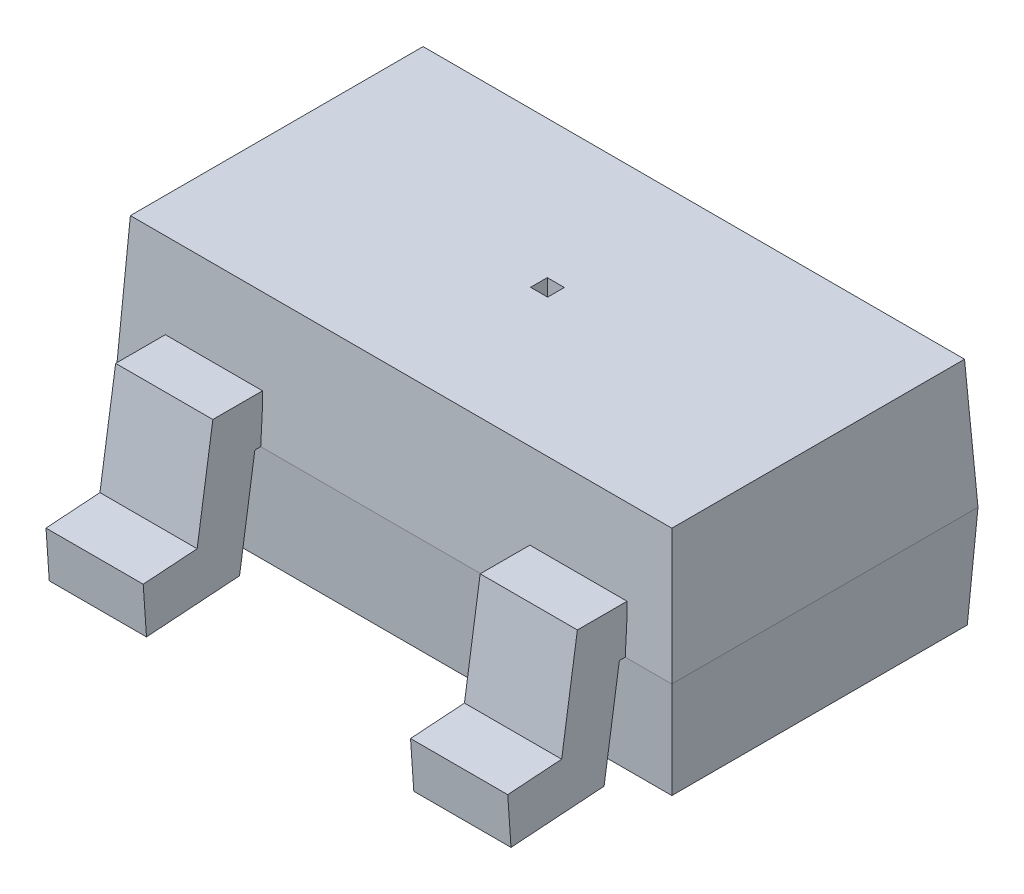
from build123d import *

# Parameters (mm, degrees)
SKETCH1_W           = 2.9
SKETCH1_H           = 1.6
BOSS_EXTRUDE1_DEPTH = 0.533
BOSS_EXTRUDE1_DRAFT = -3
SKETCH5_W           = 2.9
SKETCH5_H           = 1.6
BOSS_EXTRUDE4_DEPTH = 0.67
BOSS_EXTRUDE4_TAPER = 3
BOSS_EXTRUDE5_DEPTH = 0.254
BOSS_EXTRUDE6_START = 0.6985
BOSS_EXTRUDE6_DEPTH = 0.508
BOSS_EXTRUDE7_START = -0.6985
BOSS_EXTRUDE7_DEPTH = 0.508
SKETCH9_W           = 0.089302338
SKETCH9_H           = 0.087441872
CUT_EXTRUDE1_DEPTH  = 0.762


with BuildPart() as part:
    # Sketch1 → Boss-Extrude1 (with draft: the straight prism first)
    with BuildSketch(Plane(origin=(0, 0, 0), x_dir=(1, 0, 0), z_dir=(0, 1, 0))):
        Rectangle(SKETCH1_W, SKETCH1_H)
    extrude(amount=-BOSS_EXTRUDE1_DEPTH)
    # Boss-Extrude1: the draft: its side faces are tilted about the plane it starts from
    boss_extrude1_sides = [part.faces().sort_by_distance(p)[0] for p in [
        (-1.45, -0.2665, 0),
        (0, -0.2665, 0.8),
        (1.45, -0.2665, 0),
        (0, -0.2665, -0.8),
    ]]
    draft(boss_extrude1_sides, Plane(origin=(0, 0, 0), x_dir=(1, 0, 0), z_dir=(0, 1, 0)), BOSS_EXTRUDE1_DRAFT)

    # Sketch5 → Boss-Extrude4 (add)
    with BuildSketch(Plane(origin=(0, 0, 0), x_dir=(1, 0, 0), z_dir=(0, 1, 0))):
        Rectangle(SKETCH5_W, SKETCH5_H)
    extrude(amount=BOSS_EXTRUDE4_DEPTH, taper=BOSS_EXTRUDE4_TAPER)

    # Sketch6 → Boss-Extrude5 (add, symmetric)
    with BuildSketch(Plane(origin=(0, 0, 0), x_dir=(0, 0, -1), z_dir=(1, 0, 0))):
        Polygon((0.790460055, 0), (0.830732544, 0), (0.910586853, -0.529179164), (1.397, -0.562855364), (1.414128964, -0.315447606), (1.132265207, -0.295933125), (1.050184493, 0.248), (0.790460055, 0.248), align=None)
    extrude(amount=BOSS_EXTRUDE5_DEPTH, both=True)

    # Sketch7 → Boss-Extrude6 (add)
    with BuildSketch(Plane(origin=(0, 0, 0), x_dir=(0, 0, -1), z_dir=(1, 0, 0)).offset(BOSS_EXTRUDE6_START)):
        Polygon((-0.790460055, 0.248), (-0.790460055, 0), (-0.830732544, 0), (-0.910586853, -0.529179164), (-1.397, -0.562855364), (-1.414128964, -0.315447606), (-1.132265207, -0.295933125), (-1.050184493, 0.248), align=None)
    extrude(amount=BOSS_EXTRUDE6_DEPTH)

    # Sketch8 → Boss-Extrude7 (add)
    with BuildSketch(Plane(origin=(0, 0, 0), x_dir=(0, 0, -1), z_dir=(1, 0, 0)).offset(BOSS_EXTRUDE7_START)):
        Polygon((-0.790460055, 0), (-0.830732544, 0), (-0.910586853, -0.529179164), (-1.397, -0.562855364), (-1.414128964, -0.315447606), (-1.132265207, -0.295933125), (-1.050184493, 0.248), (-0.790460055, 0.248), align=None)
    extrude(amount=-BOSS_EXTRUDE7_DEPTH)

    # Sketch9 → Cut-Extrude1 (cut)
    with BuildSketch(Plane(origin=(0, 0.67, 0), x_dir=(1, 0, 0), z_dir=(0, 1, 0))):
        Rectangle(SKETCH9_W, SKETCH9_H)
    extrude(amount=-CUT_EXTRUDE1_DEPTH, mode=Mode.SUBTRACT)


solid = part.part
